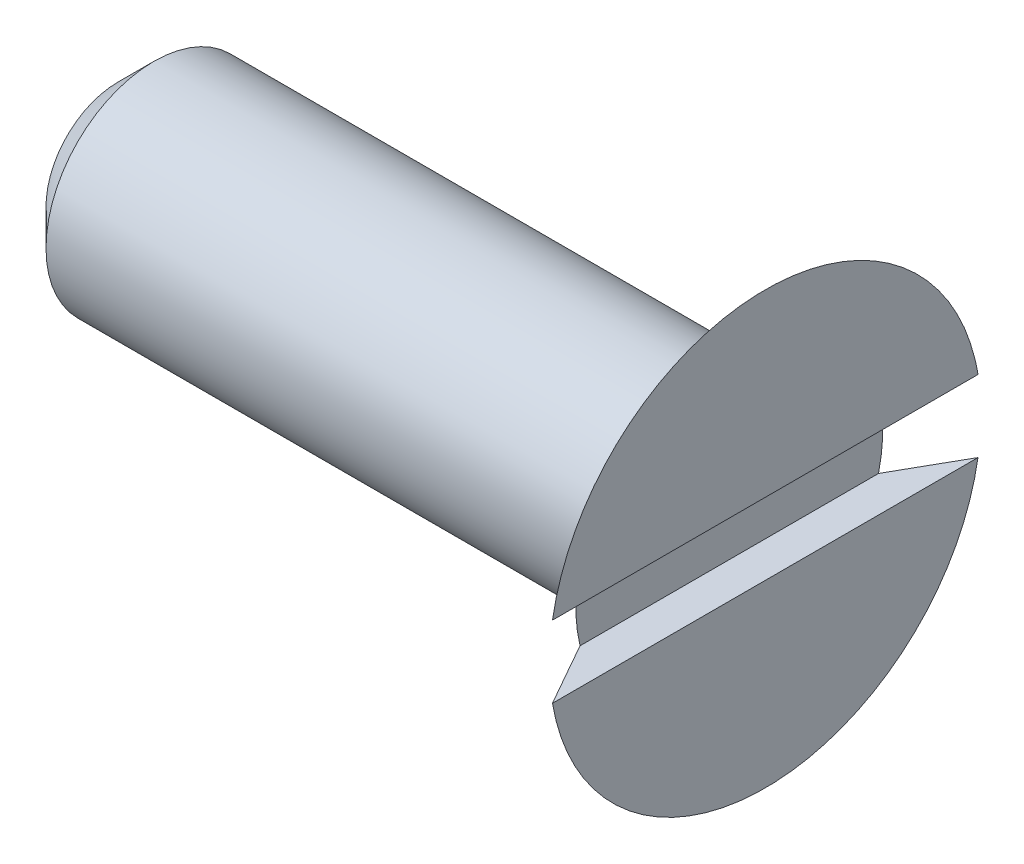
from build123d import *

# Parameters (mm, degrees)
CHANFREIN1_SIZE         = 1
ESQUISSE2_W             = 13.304768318
ESQUISSE2_H             = 2
ENL_V_MAT_EXTRU_1_DEPTH = 1


with BuildPart() as part:
    # Esquisse1 → R_volution1 (revolve)
    with BuildSketch(Plane.XY, mode=Mode.PRIVATE) as r_volution1_sk:
        Polygon((25.090675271, 0), (25.090675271, 3), (41.358624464, 3), (43.090675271, 6), (43.090675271, 0), align=None)
    revolve(r_volution1_sk.sketch.rotate(Axis((25.090675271, 0, 0), (1, 0, 0)), 180), axis=Axis((25.090675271, 0, 0), (1, 0, 0)))

    # Chanfrein1
    chanfrein1_edges = [part.edges().sort_by_distance(p)[0] for p in [
        (25.090675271, 3, 0),
    ]]
    chamfer(chanfrein1_edges, length=CHANFREIN1_SIZE)

    # Esquisse2 → Enl_v. mat.-Extru.1 (cut)
    with BuildSketch(Plane(origin=(43.090675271, 0, 0), x_dir=(0, 0, -1), z_dir=(1, 0, 0))):
        with Locations((0.017955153, 0)):
            Rectangle(ESQUISSE2_W, ESQUISSE2_H)
    extrude(amount=-ENL_V_MAT_EXTRU_1_DEPTH, mode=Mode.SUBTRACT)


solid = part.part
